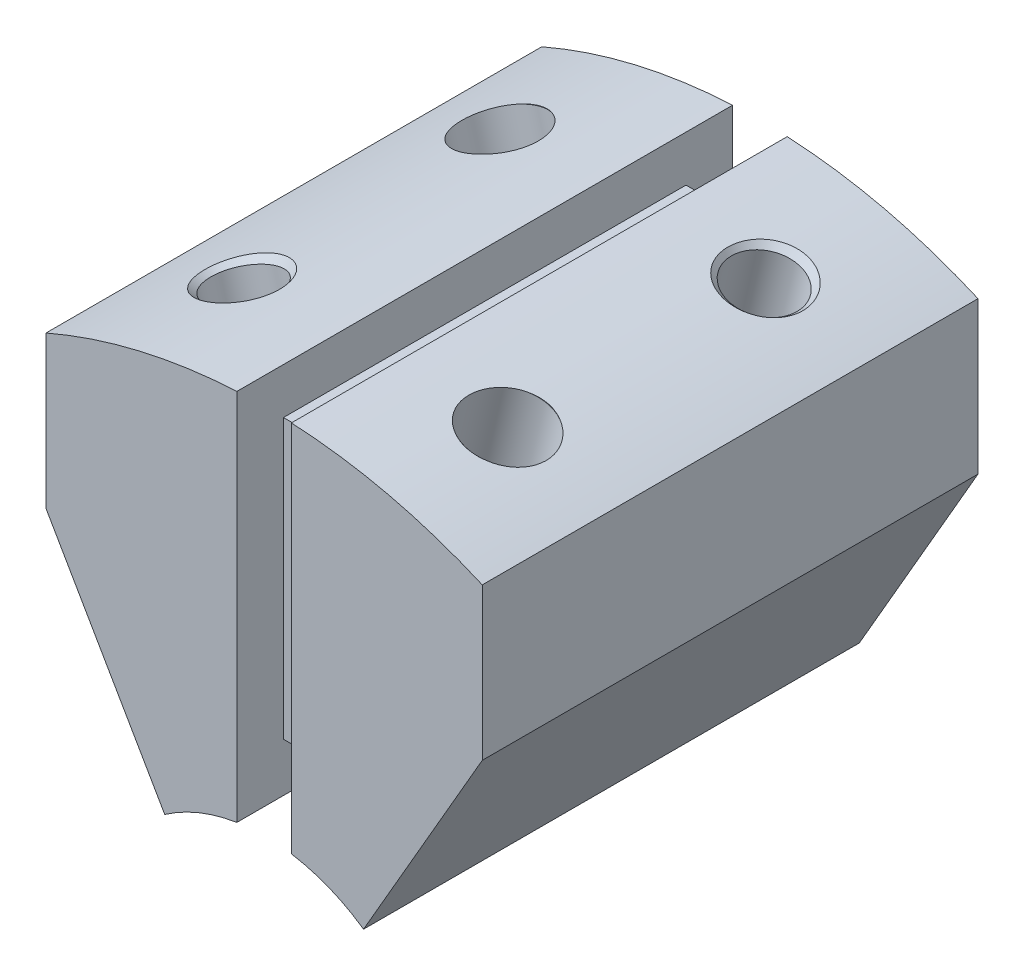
from build123d import *

# Parameters (mm, degrees)
EXTRUDE_2_DEPTH              = 25
SKETCH_7_W                   = 5.5
SKETCH_7_H                   = 4.7
CUT_EXTRUDE_1_DEPTH          = 50.009345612
F_8_0MM_3_D                  = 8
F_8_0MM_3_DEPTH              = 15
F_8_0MM_3_CSINK_D            = 8.05
F_8_0MM_3_CSINK_ANGLE        = 90
F_8_0MM_3_TIP                = 2.403442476
F_8_0MM_4_D                  = 8
F_8_0MM_4_DEPTH              = 15
F_8_0MM_4_CSINK_D            = 8.05
F_8_0MM_4_CSINK_ANGLE        = 90
F_8_0MM_4_TIP                = 2.403442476
HOLE_WIZARD_M8_1_D           = 6.8
HOLE_WIZARD_M8_1_DEPTH       = 18
HOLE_WIZARD_M8_1_CSINK_D     = 8.05
HOLE_WIZARD_M8_1_CSINK_ANGLE = 90
HOLE_WIZARD_M8_1_TIP         = 2.042926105
HOLE_WIZARD_M8_2_D           = 6.8
HOLE_WIZARD_M8_2_DEPTH       = 18
HOLE_WIZARD_M8_2_CSINK_D     = 8.05
HOLE_WIZARD_M8_2_CSINK_ANGLE = 90
HOLE_WIZARD_M8_2_TIP         = 2.042926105


with BuildPart() as part:
    # Sketch 1 → Extrude 2 (new, symmetric)
    with BuildSketch(Plane.XY):
        with BuildLine():
            Line((-22, 50.408332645), (-22, 35.0814246))
            Line((-22, 35.0814246), (-10.026583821, 14.342859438))
            ThreePointArc((-10.026583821, 14.342859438), (-6.555208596, 16.225881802), (-2.75, 17.282577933))
            Line((-2.75, 17.282577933), (-2.75, 22.2))
            Line((-2.75, 22.2), (2.75, 22.2))
            Line((2.75, 22.2), (2.75, 17.282577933))
            ThreePointArc((2.75, 17.282577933), (6.555208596, 16.225881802), (10.026583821, 14.342859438))
            Line((10.026583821, 14.342859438), (22, 35.0814246))
            Line((22, 35.0814246), (22, 50.408332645))
            ThreePointArc((22, 50.408332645), (12.579933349, 53.541995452), (2.75, 54.931206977))
            Line((2.75, 54.931206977), (2.75, 50.3))
            Line((2.75, 50.3), (-2.75, 50.3))
            Line((-2.75, 50.3), (-2.75, 54.931206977))
            ThreePointArc((-2.75, 54.931206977), (-12.579933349, 53.541995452), (-22, 50.408332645))
        make_face()
    extrude(amount=EXTRUDE_2_DEPTH, both=True)

    # Sketch 7 → Cut-Extrude 1 (cut, through all)
    with BuildSketch(Plane(origin=(0, 50.3, 0), x_dir=(1, 0, 0), z_dir=(0, 1, 0))):
        with Locations((0, 22.65)):
            Rectangle(SKETCH_7_W, SKETCH_7_H)
        with Locations((0, -22.65)):
            Rectangle(SKETCH_7_W, SKETCH_7_H)
    extrude(amount=-CUT_EXTRUDE_1_DEPTH, mode=Mode.SUBTRACT)

    # 8.0mm _3
    with Locations(Plane(origin=(-14.235047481, 53.125920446, -13), x_dir=(0.965925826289, 0.258819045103, 0), z_dir=(-0.258819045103, 0.965925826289, 0))):
        with Locations((0, 0)):
            CounterSinkHole(F_8_0MM_3_D / 2, F_8_0MM_3_CSINK_D / 2, depth=F_8_0MM_3_DEPTH, counter_sink_angle=F_8_0MM_3_CSINK_ANGLE)
            with Locations((0, 0, -(F_8_0MM_3_DEPTH + F_8_0MM_3_TIP / 2))):  # 118° drill point
                Cone(0, F_8_0MM_3_D / 2, F_8_0MM_3_TIP, mode=Mode.SUBTRACT)

    # 8.0mm _4
    with Locations(Plane(origin=(12.579933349, 53.541995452, 13), x_dir=(0.973490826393, -0.228726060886, 0), z_dir=(0.228726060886, 0.973490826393, 0))):
        with Locations((0, 0)):
            CounterSinkHole(F_8_0MM_4_D / 2, F_8_0MM_4_CSINK_D / 2, depth=F_8_0MM_4_DEPTH, counter_sink_angle=F_8_0MM_4_CSINK_ANGLE)
            with Locations((0, 0, -(F_8_0MM_4_DEPTH + F_8_0MM_4_TIP / 2))):  # 118° drill point
                Cone(0, F_8_0MM_4_D / 2, F_8_0MM_4_TIP, mode=Mode.SUBTRACT)

    # Hole Wizard M8 _1
    with Locations(Plane(origin=(-14.235047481, 53.125920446, 13), x_dir=(0.965925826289, 0.258819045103, 0), z_dir=(-0.258819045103, 0.965925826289, 0))):
        with Locations((0, 0)):
            CounterSinkHole(HOLE_WIZARD_M8_1_D / 2, HOLE_WIZARD_M8_1_CSINK_D / 2, depth=HOLE_WIZARD_M8_1_DEPTH, counter_sink_angle=HOLE_WIZARD_M8_1_CSINK_ANGLE)
            with Locations((0, 0, -(HOLE_WIZARD_M8_1_DEPTH + HOLE_WIZARD_M8_1_TIP / 2))):  # 118° drill point
                Cone(0, HOLE_WIZARD_M8_1_D / 2, HOLE_WIZARD_M8_1_TIP, mode=Mode.SUBTRACT)

    # Hole Wizard M8 _2
    with Locations(Plane(origin=(12.579933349, 53.541995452, -13), x_dir=(0.973490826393, -0.228726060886, 0), z_dir=(0.228726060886, 0.973490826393, 0))):
        with Locations((0, 0)):
            CounterSinkHole(HOLE_WIZARD_M8_2_D / 2, HOLE_WIZARD_M8_2_CSINK_D / 2, depth=HOLE_WIZARD_M8_2_DEPTH, counter_sink_angle=HOLE_WIZARD_M8_2_CSINK_ANGLE)
            with Locations((0, 0, -(HOLE_WIZARD_M8_2_DEPTH + HOLE_WIZARD_M8_2_TIP / 2))):  # 118° drill point
                Cone(0, HOLE_WIZARD_M8_2_D / 2, HOLE_WIZARD_M8_2_TIP, mode=Mode.SUBTRACT)


solid = part.part
